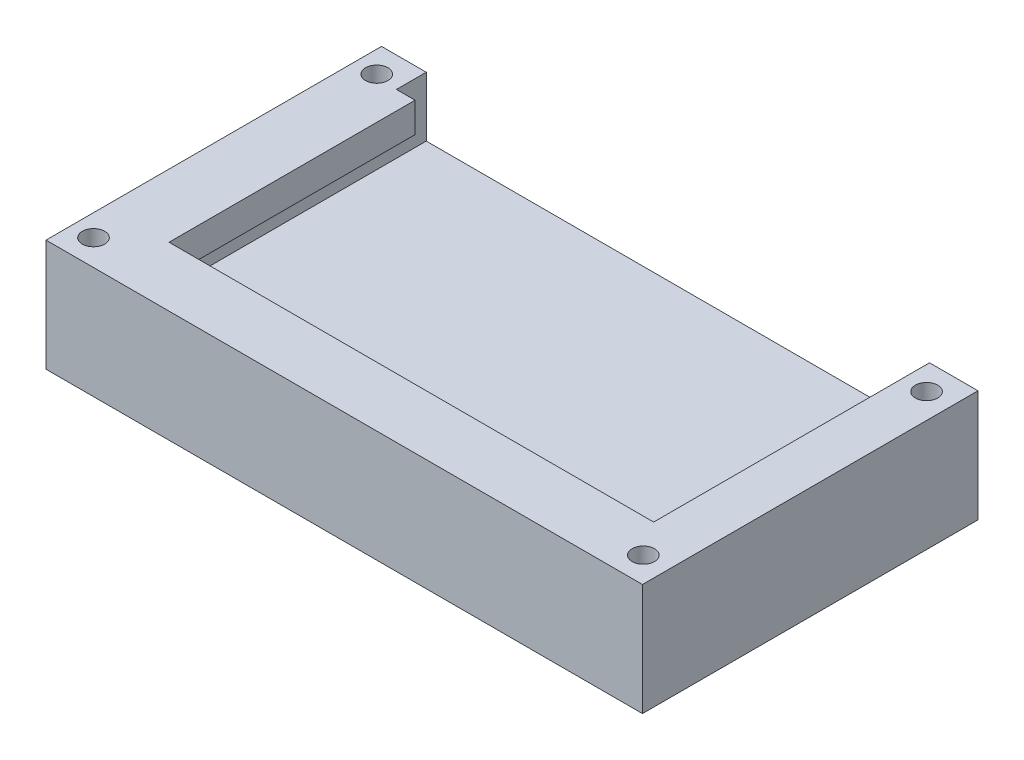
from build123d import *

# Parameters (mm, degrees)
SKETCH1_W               = 80
SKETCH1_H               = 45
BOSS_EXTRUDE1_DEPTH     = 15
SKETCH2_W               = 67.5
SKETCH2_H               = 37
CUT_EXTRUDE1_DEPTH      = 8
SKETCH4_W               = 2.5
SKETCH4_H               = 33
BOSS_EXTRUDE2_DEPTH     = 4
CUT_EXTRUDE2_DEPTH      = 94.005376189
CUT_EXTRUDE2_DEPTH_BACK = 94.005376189
SKETCH5_R               = 1.5


with BuildPart() as part:
    # Sketch1 → Boss-Extrude1 (new body)
    with BuildSketch(Plane(origin=(0, 0, 0), x_dir=(1, 0, 0), z_dir=(0, 1, 0))):
        with Locations((40, 22.5)):
            Rectangle(SKETCH1_W, SKETCH1_H)
    extrude(amount=BOSS_EXTRUDE1_DEPTH)

    # Sketch2 → Cut-Extrude1 (cut)
    with BuildSketch(Plane(origin=(0, 15, 0), x_dir=(1, 0, 0), z_dir=(0, 1, 0))):
        with Locations((39.75, 26.5)):
            Rectangle(SKETCH2_W, SKETCH2_H)
    extrude(amount=-CUT_EXTRUDE1_DEPTH, mode=Mode.SUBTRACT)

    # Sketch4 → Boss-Extrude2 (add)
    with BuildSketch(Plane(origin=(0, 15, 0), x_dir=(1, 0, 0), z_dir=(0, 1, 0))):
        with Locations((7.25, 24.5)):
            Rectangle(SKETCH4_W, SKETCH4_H)
    extrude(amount=-BOSS_EXTRUDE2_DEPTH)

    # Sketch5 → Cut-Extrude2 (cut, two sides: drawn at the far end of the back side and taken through both)
    with BuildSketch(Plane(origin=(0, 15, 0), x_dir=(1, 0, 0), z_dir=(0, 1, 0)).offset(-CUT_EXTRUDE2_DEPTH_BACK)):
        with Locations(Location((2.90539873, 41.453364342, 0), (0, 0, 270))):
            Circle(SKETCH5_R)
        with Locations(Location((76.648320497, 3.466999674, 0), (0, 0, 270))):
            Circle(SKETCH5_R)
        with Locations(Location((76.648320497, 41.453364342, 0), (0, 0, 270))):
            Circle(SKETCH5_R)
        with Locations(Location((2.90539873, 3.466999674, 0), (0, 0, 270))):
            Circle(SKETCH5_R)
    extrude(amount=CUT_EXTRUDE2_DEPTH + CUT_EXTRUDE2_DEPTH_BACK, mode=Mode.SUBTRACT)


solid = part.part
